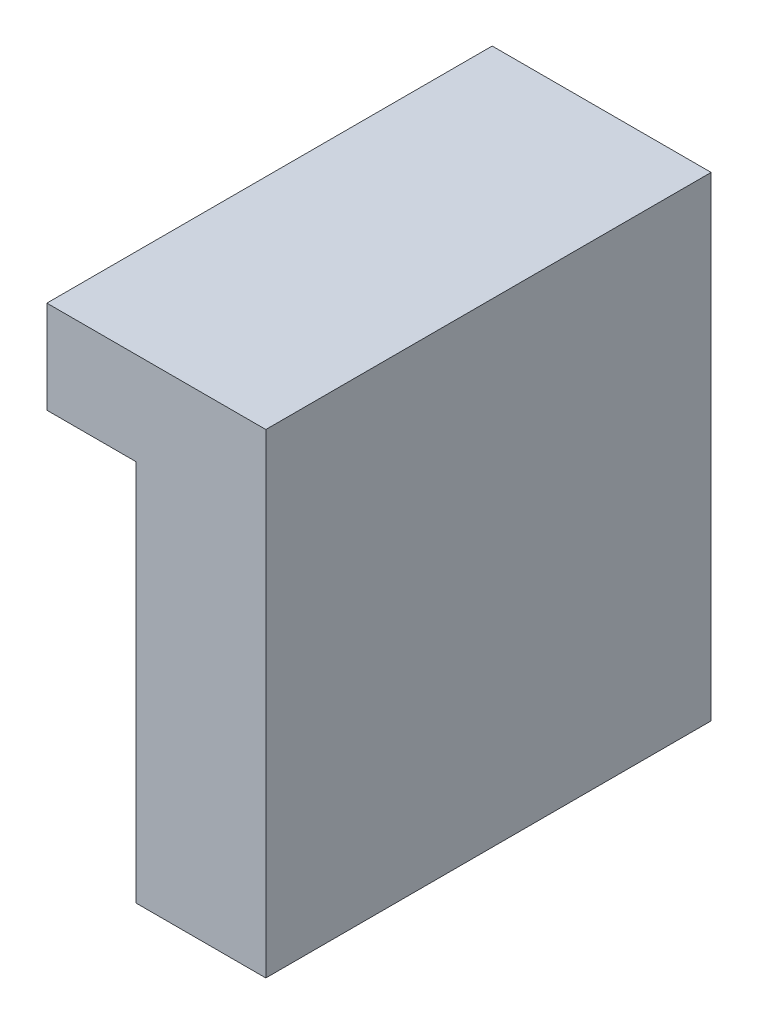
ISO-10303-21;
HEADER;
FILE_DESCRIPTION(('STEP AP214'),'2;1');
FILE_NAME('part.step','',(''),(''),'','','');
FILE_SCHEMA(('AUTOMOTIVE_DESIGN { 1 0 10303 214 1 1 1 1 }'));
ENDSEC;
DATA;
#1=APPLICATION_CONTEXT('core data for automotive mechanical design processes');
#2=APPLICATION_PROTOCOL_DEFINITION('international standard','automotive_design',2000,#1);
#3=PRODUCT_CONTEXT('',#1,'mechanical');
#4=PRODUCT('Part','Part','',(#3));
#5=PRODUCT_RELATED_PRODUCT_CATEGORY('part','',(#4));
#6=PRODUCT_DEFINITION_FORMATION('','',#4);
#7=PRODUCT_DEFINITION_CONTEXT('part definition',#1,'design');
#8=PRODUCT_DEFINITION('design','',#6,#7);
#9=PRODUCT_DEFINITION_SHAPE('','',#8);
#10=(LENGTH_UNIT() NAMED_UNIT(*) SI_UNIT(.MILLI.,.METRE.));
#11=(NAMED_UNIT(*) PLANE_ANGLE_UNIT() SI_UNIT($,.RADIAN.));
#12=(NAMED_UNIT(*) SI_UNIT($,.STERADIAN.) SOLID_ANGLE_UNIT());
#13=UNCERTAINTY_MEASURE_WITH_UNIT(LENGTH_MEASURE(1.E-05),#10,'distance_accuracy_value','');
#14=(GEOMETRIC_REPRESENTATION_CONTEXT(3) GLOBAL_UNCERTAINTY_ASSIGNED_CONTEXT((#13)) GLOBAL_UNIT_ASSIGNED_CONTEXT((#10,
#11,#12)) REPRESENTATION_CONTEXT('',''));
#15=CARTESIAN_POINT('',(0.,0.,0.));
#16=DIRECTION('',(0.,0.,1.));
#17=DIRECTION('',(1.,0.,0.));
#18=AXIS2_PLACEMENT_3D('',#15,#16,#17);
#19=CARTESIAN_POINT('',(-35.0000000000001,0.,-120.));
#20=DIRECTION('',(0.,-1.,0.));
#21=DIRECTION('',(0.,0.,-1.));
#22=AXIS2_PLACEMENT_3D('',#19,#20,#21);
#23=PLANE('',#22);
#24=DIRECTION('',(1.,0.,0.));
#25=VECTOR('',#24,1.);
#26=CARTESIAN_POINT('',(-35.0000000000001,0.,0.));
#27=LINE('',#26,#25);
#28=CARTESIAN_POINT('',(-35.0000000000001,0.,0.));
#29=VERTEX_POINT('',#28);
#30=CARTESIAN_POINT('',(0.,0.,0.));
#31=VERTEX_POINT('',#30);
#32=EDGE_CURVE('E135',#29,#31,#27,.T.);
#33=ORIENTED_EDGE('',*,*,#32,.F.);
#34=DIRECTION('',(0.,0.,1.));
#35=VECTOR('',#34,1.);
#36=CARTESIAN_POINT('',(-35.0000000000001,0.,-120.));
#37=LINE('',#36,#35);
#38=CARTESIAN_POINT('',(-35.0000000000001,0.,-120.));
#39=VERTEX_POINT('',#38);
#40=EDGE_CURVE('E11',#39,#29,#37,.T.);
#41=ORIENTED_EDGE('',*,*,#40,.F.);
#42=DIRECTION('',(1.,0.,0.));
#43=VECTOR('',#42,1.);
#44=CARTESIAN_POINT('',(-35.0000000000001,0.,-120.));
#45=LINE('',#44,#43);
#46=CARTESIAN_POINT('',(0.,0.,-120.));
#47=VERTEX_POINT('',#46);
#48=EDGE_CURVE('E155',#39,#47,#45,.T.);
#49=ORIENTED_EDGE('',*,*,#48,.T.);
#50=DIRECTION('',(0.,0.,1.));
#51=VECTOR('',#50,1.);
#52=CARTESIAN_POINT('',(0.,0.,-120.));
#53=LINE('',#52,#51);
#54=EDGE_CURVE('E42',#47,#31,#53,.T.);
#55=ORIENTED_EDGE('',*,*,#54,.T.);
#56=EDGE_LOOP('',(#33,#41,#49,#55));
#57=FACE_BOUND('',#56,.T.);
#58=ADVANCED_FACE('F39',(#57),#23,.T.);
#59=CARTESIAN_POINT('',(-35.,103.,-120.));
#60=DIRECTION('',(-1.,0.,0.));
#61=DIRECTION('',(0.,-1.,0.));
#62=AXIS2_PLACEMENT_3D('',#59,#60,#61);
#63=PLANE('',#62);
#64=DIRECTION('',(0.,-1.,0.));
#65=VECTOR('',#64,1.);
#66=CARTESIAN_POINT('',(-35.,103.,0.));
#67=LINE('',#66,#65);
#68=CARTESIAN_POINT('',(-35.,103.,0.));
#69=VERTEX_POINT('',#68);
#70=EDGE_CURVE('E152',#69,#29,#67,.T.);
#71=ORIENTED_EDGE('',*,*,#70,.F.);
#72=DIRECTION('',(0.,0.,1.));
#73=VECTOR('',#72,1.);
#74=CARTESIAN_POINT('',(-35.,103.,-120.));
#75=LINE('',#74,#73);
#76=CARTESIAN_POINT('',(-35.,103.,-120.));
#77=VERTEX_POINT('',#76);
#78=EDGE_CURVE('E49',#77,#69,#75,.T.);
#79=ORIENTED_EDGE('',*,*,#78,.F.);
#80=DIRECTION('',(0.,-1.,0.));
#81=VECTOR('',#80,1.);
#82=CARTESIAN_POINT('',(-35.,103.,-120.));
#83=LINE('',#82,#81);
#84=EDGE_CURVE('E124',#77,#39,#83,.T.);
#85=ORIENTED_EDGE('',*,*,#84,.T.);
#86=ORIENTED_EDGE('',*,*,#40,.T.);
#87=EDGE_LOOP('',(#71,#79,#85,#86));
#88=FACE_BOUND('',#87,.T.);
#89=ADVANCED_FACE('F169',(#88),#63,.T.);
#90=CARTESIAN_POINT('',(-59.,103.,-120.));
#91=DIRECTION('',(0.,-1.,0.));
#92=DIRECTION('',(1.,0.,0.));
#93=AXIS2_PLACEMENT_3D('',#90,#91,#92);
#94=PLANE('',#93);
#95=DIRECTION('',(1.,0.,0.));
#96=VECTOR('',#95,1.);
#97=CARTESIAN_POINT('',(-59.,103.,0.));
#98=LINE('',#97,#96);
#99=CARTESIAN_POINT('',(-59.,103.,0.));
#100=VERTEX_POINT('',#99);
#101=EDGE_CURVE('E110',#100,#69,#98,.T.);
#102=ORIENTED_EDGE('',*,*,#101,.F.);
#103=DIRECTION('',(0.,0.,1.));
#104=VECTOR('',#103,1.);
#105=CARTESIAN_POINT('',(-59.,103.,-120.));
#106=LINE('',#105,#104);
#107=CARTESIAN_POINT('',(-59.,103.,-120.));
#108=VERTEX_POINT('',#107);
#109=EDGE_CURVE('E105',#108,#100,#106,.T.);
#110=ORIENTED_EDGE('',*,*,#109,.F.);
#111=DIRECTION('',(1.,0.,0.));
#112=VECTOR('',#111,1.);
#113=CARTESIAN_POINT('',(-59.,103.,-120.));
#114=LINE('',#113,#112);
#115=EDGE_CURVE('E108',#108,#77,#114,.T.);
#116=ORIENTED_EDGE('',*,*,#115,.T.);
#117=ORIENTED_EDGE('',*,*,#78,.T.);
#118=EDGE_LOOP('',(#102,#110,#116,#117));
#119=FACE_BOUND('',#118,.T.);
#120=ADVANCED_FACE('F107',(#119),#94,.T.);
#121=CARTESIAN_POINT('',(-59.,128.,-120.));
#122=DIRECTION('',(-1.,0.,0.));
#123=DIRECTION('',(0.,0.,1.));
#124=AXIS2_PLACEMENT_3D('',#121,#122,#123);
#125=PLANE('',#124);
#126=DIRECTION('',(0.,-1.,0.));
#127=VECTOR('',#126,1.);
#128=CARTESIAN_POINT('',(-59.,128.,0.));
#129=LINE('',#128,#127);
#130=CARTESIAN_POINT('',(-59.,128.,0.));
#131=VERTEX_POINT('',#130);
#132=EDGE_CURVE('E147',#131,#100,#129,.T.);
#133=ORIENTED_EDGE('',*,*,#132,.F.);
#134=DIRECTION('',(0.,0.,1.));
#135=VECTOR('',#134,1.);
#136=CARTESIAN_POINT('',(-59.,128.,-120.));
#137=LINE('',#136,#135);
#138=CARTESIAN_POINT('',(-59.,128.,-120.));
#139=VERTEX_POINT('',#138);
#140=EDGE_CURVE('E116',#139,#131,#137,.T.);
#141=ORIENTED_EDGE('',*,*,#140,.F.);
#142=DIRECTION('',(0.,-1.,0.));
#143=VECTOR('',#142,1.);
#144=CARTESIAN_POINT('',(-59.,128.,-120.));
#145=LINE('',#144,#143);
#146=EDGE_CURVE('E122',#139,#108,#145,.T.);
#147=ORIENTED_EDGE('',*,*,#146,.T.);
#148=ORIENTED_EDGE('',*,*,#109,.T.);
#149=EDGE_LOOP('',(#133,#141,#147,#148));
#150=FACE_BOUND('',#149,.T.);
#151=ADVANCED_FACE('F126',(#150),#125,.T.);
#152=CARTESIAN_POINT('',(0.,128.,-120.));
#153=DIRECTION('',(0.,1.,0.));
#154=DIRECTION('',(-1.,0.,0.));
#155=AXIS2_PLACEMENT_3D('',#152,#153,#154);
#156=PLANE('',#155);
#157=DIRECTION('',(-1.,0.,0.));
#158=VECTOR('',#157,1.);
#159=CARTESIAN_POINT('',(0.,128.,0.));
#160=LINE('',#159,#158);
#161=CARTESIAN_POINT('',(0.,128.,0.));
#162=VERTEX_POINT('',#161);
#163=EDGE_CURVE('E143',#162,#131,#160,.T.);
#164=ORIENTED_EDGE('',*,*,#163,.F.);
#165=DIRECTION('',(0.,0.,1.));
#166=VECTOR('',#165,1.);
#167=CARTESIAN_POINT('',(0.,128.,-120.));
#168=LINE('',#167,#166);
#169=CARTESIAN_POINT('',(0.,128.,-120.));
#170=VERTEX_POINT('',#169);
#171=EDGE_CURVE('E160',#170,#162,#168,.T.);
#172=ORIENTED_EDGE('',*,*,#171,.F.);
#173=DIRECTION('',(-1.,0.,0.));
#174=VECTOR('',#173,1.);
#175=CARTESIAN_POINT('',(0.,128.,-120.));
#176=LINE('',#175,#174);
#177=EDGE_CURVE('E127',#170,#139,#176,.T.);
#178=ORIENTED_EDGE('',*,*,#177,.T.);
#179=ORIENTED_EDGE('',*,*,#140,.T.);
#180=EDGE_LOOP('',(#164,#172,#178,#179));
#181=FACE_BOUND('',#180,.T.);
#182=ADVANCED_FACE('F182',(#181),#156,.T.);
#183=CARTESIAN_POINT('',(0.,0.,-120.));
#184=DIRECTION('',(1.,0.,0.));
#185=DIRECTION('',(0.,1.,0.));
#186=AXIS2_PLACEMENT_3D('',#183,#184,#185);
#187=PLANE('',#186);
#188=DIRECTION('',(0.,1.,0.));
#189=VECTOR('',#188,1.);
#190=CARTESIAN_POINT('',(0.,0.,0.));
#191=LINE('',#190,#189);
#192=EDGE_CURVE('E139',#31,#162,#191,.T.);
#193=ORIENTED_EDGE('',*,*,#192,.F.);
#194=ORIENTED_EDGE('',*,*,#54,.F.);
#195=DIRECTION('',(0.,1.,0.));
#196=VECTOR('',#195,1.);
#197=CARTESIAN_POINT('',(0.,0.,-120.));
#198=LINE('',#197,#196);
#199=EDGE_CURVE('E129',#47,#170,#198,.T.);
#200=ORIENTED_EDGE('',*,*,#199,.T.);
#201=ORIENTED_EDGE('',*,*,#171,.T.);
#202=EDGE_LOOP('',(#193,#194,#200,#201));
#203=FACE_BOUND('',#202,.T.);
#204=ADVANCED_FACE('F166',(#203),#187,.T.);
#205=CARTESIAN_POINT('',(0.,0.,-120.));
#206=DIRECTION('',(0.,0.,1.));
#207=DIRECTION('',(1.,0.,0.));
#208=AXIS2_PLACEMENT_3D('',#205,#206,#207);
#209=PLANE('',#208);
#210=ORIENTED_EDGE('',*,*,#48,.F.);
#211=ORIENTED_EDGE('',*,*,#84,.F.);
#212=ORIENTED_EDGE('',*,*,#115,.F.);
#213=ORIENTED_EDGE('',*,*,#146,.F.);
#214=ORIENTED_EDGE('',*,*,#177,.F.);
#215=ORIENTED_EDGE('',*,*,#199,.F.);
#216=EDGE_LOOP('',(#210,#211,#212,#213,#214,#215));
#217=FACE_BOUND('',#216,.T.);
#218=ADVANCED_FACE('F120',(#217),#209,.F.);
#219=CARTESIAN_POINT('',(0.,0.,0.));
#220=DIRECTION('',(0.,0.,1.));
#221=DIRECTION('',(1.,0.,0.));
#222=AXIS2_PLACEMENT_3D('',#219,#220,#221);
#223=PLANE('',#222);
#224=ORIENTED_EDGE('',*,*,#32,.T.);
#225=ORIENTED_EDGE('',*,*,#192,.T.);
#226=ORIENTED_EDGE('',*,*,#163,.T.);
#227=ORIENTED_EDGE('',*,*,#132,.T.);
#228=ORIENTED_EDGE('',*,*,#101,.T.);
#229=ORIENTED_EDGE('',*,*,#70,.T.);
#230=EDGE_LOOP('',(#224,#225,#226,#227,#228,#229));
#231=FACE_BOUND('',#230,.T.);
#232=ADVANCED_FACE('F168',(#231),#223,.T.);
#233=CLOSED_SHELL('',(#58,#89,#120,#151,#182,#204,#218,#232));
#234=MANIFOLD_SOLID_BREP('B2',#233);
#235=ADVANCED_BREP_SHAPE_REPRESENTATION('',(#18,#234),#14);
#236=SHAPE_DEFINITION_REPRESENTATION(#9,#235);
ENDSEC;
END-ISO-10303-21;
